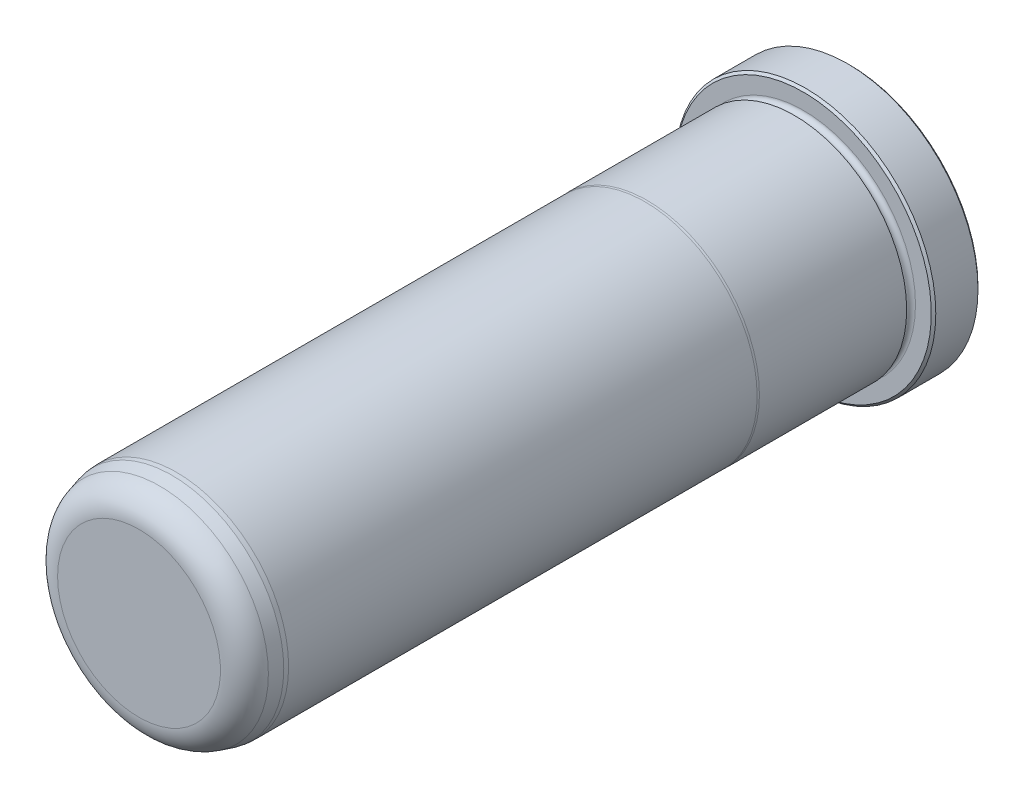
ISO-10303-21;
HEADER;
FILE_DESCRIPTION(('STEP AP214'),'2;1');
FILE_NAME('part.step','',(''),(''),'','','');
FILE_SCHEMA(('AUTOMOTIVE_DESIGN { 1 0 10303 214 1 1 1 1 }'));
ENDSEC;
DATA;
#1=APPLICATION_CONTEXT('core data for automotive mechanical design processes');
#2=APPLICATION_PROTOCOL_DEFINITION('international standard','automotive_design',2000,#1);
#3=PRODUCT_CONTEXT('',#1,'mechanical');
#4=PRODUCT('Part','Part','',(#3));
#5=PRODUCT_RELATED_PRODUCT_CATEGORY('part','',(#4));
#6=PRODUCT_DEFINITION_FORMATION('','',#4);
#7=PRODUCT_DEFINITION_CONTEXT('part definition',#1,'design');
#8=PRODUCT_DEFINITION('design','',#6,#7);
#9=PRODUCT_DEFINITION_SHAPE('','',#8);
#10=(LENGTH_UNIT() NAMED_UNIT(*) SI_UNIT(.MILLI.,.METRE.));
#11=(NAMED_UNIT(*) PLANE_ANGLE_UNIT() SI_UNIT($,.RADIAN.));
#12=(NAMED_UNIT(*) SI_UNIT($,.STERADIAN.) SOLID_ANGLE_UNIT());
#13=UNCERTAINTY_MEASURE_WITH_UNIT(LENGTH_MEASURE(1.E-05),#10,'distance_accuracy_value','');
#14=(GEOMETRIC_REPRESENTATION_CONTEXT(3) GLOBAL_UNCERTAINTY_ASSIGNED_CONTEXT((#13)) GLOBAL_UNIT_ASSIGNED_CONTEXT((#10,
#11,#12)) REPRESENTATION_CONTEXT('',''));
#15=CARTESIAN_POINT('',(0.,0.,0.));
#16=DIRECTION('',(0.,0.,1.));
#17=DIRECTION('',(1.,0.,0.));
#18=AXIS2_PLACEMENT_3D('',#15,#16,#17);
#19=CARTESIAN_POINT('',(0.,0.,0.));
#20=DIRECTION('',(0.,0.,1.));
#21=DIRECTION('',(1.,0.,0.));
#22=AXIS2_PLACEMENT_3D('',#19,#20,#21);
#23=PLANE('',#22);
#24=CARTESIAN_POINT('',(0.,0.,0.));
#25=DIRECTION('',(0.,0.,1.));
#26=DIRECTION('',(1.,0.,0.));
#27=AXIS2_PLACEMENT_3D('',#24,#25,#26);
#28=CIRCLE('',#27,21.717);
#29=CARTESIAN_POINT('',(21.717,0.,0.));
#30=VERTEX_POINT('',#29);
#31=EDGE_CURVE('E37',#30,#30,#28,.F.);
#32=ORIENTED_EDGE('',*,*,#31,.T.);
#33=EDGE_LOOP('',(#32));
#34=FACE_BOUND('',#33,.T.);
#35=ADVANCED_FACE('F30',(#34),#23,.F.);
#36=CARTESIAN_POINT('',(0.,0.,0.));
#37=DIRECTION('',(0.,0.,1.));
#38=DIRECTION('',(1.,0.,0.));
#39=AXIS2_PLACEMENT_3D('',#36,#37,#38);
#40=CYLINDRICAL_SURFACE('',#39,22.098);
#41=CARTESIAN_POINT('',(0.,0.,0.38100000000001));
#42=DIRECTION('',(0.,0.,1.));
#43=DIRECTION('',(1.,0.,0.));
#44=AXIS2_PLACEMENT_3D('',#41,#42,#43);
#45=CIRCLE('',#44,22.098);
#46=CARTESIAN_POINT('',(22.098,0.,0.38100000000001));
#47=VERTEX_POINT('',#46);
#48=EDGE_CURVE('E41',#47,#47,#45,.T.);
#49=ORIENTED_EDGE('',*,*,#48,.T.);
#50=EDGE_LOOP('',(#49));
#51=FACE_BOUND('',#50,.T.);
#52=CARTESIAN_POINT('',(0.,0.,7.5438));
#53=DIRECTION('',(0.,0.,-1.));
#54=DIRECTION('',(-1.,0.,0.));
#55=AXIS2_PLACEMENT_3D('',#52,#53,#54);
#56=CIRCLE('',#55,22.098);
#57=CARTESIAN_POINT('',(-22.098,0.,7.5438));
#58=VERTEX_POINT('',#57);
#59=EDGE_CURVE('E45',#58,#58,#56,.T.);
#60=ORIENTED_EDGE('',*,*,#59,.T.);
#61=EDGE_LOOP('',(#60));
#62=FACE_BOUND('',#61,.T.);
#63=ADVANCED_FACE('F118',(#51,#62),#40,.T.);
#64=CARTESIAN_POINT('',(0.,22.098,7.9248));
#65=DIRECTION('',(0.,0.,-1.));
#66=DIRECTION('',(-1.,0.,0.));
#67=AXIS2_PLACEMENT_3D('',#64,#65,#66);
#68=PLANE('',#67);
#69=CARTESIAN_POINT('',(0.,0.,7.9248));
#70=DIRECTION('',(0.,0.,-1.));
#71=DIRECTION('',(-1.,0.,0.));
#72=AXIS2_PLACEMENT_3D('',#69,#70,#71);
#73=CIRCLE('',#72,21.717);
#74=CARTESIAN_POINT('',(-21.717,0.,7.9248));
#75=VERTEX_POINT('',#74);
#76=EDGE_CURVE('E10',#75,#75,#73,.F.);
#77=ORIENTED_EDGE('',*,*,#76,.T.);
#78=EDGE_LOOP('',(#77));
#79=FACE_BOUND('',#78,.T.);
#80=CARTESIAN_POINT('',(0.,0.,7.9248));
#81=DIRECTION('',(0.,0.,1.));
#82=DIRECTION('',(1.,0.,0.));
#83=AXIS2_PLACEMENT_3D('',#80,#81,#82);
#84=CIRCLE('',#83,19.0373);
#85=CARTESIAN_POINT('',(19.0373,0.,7.9248));
#86=VERTEX_POINT('',#85);
#87=EDGE_CURVE('E56',#86,#86,#84,.T.);
#88=ORIENTED_EDGE('',*,*,#87,.F.);
#89=EDGE_LOOP('',(#88));
#90=FACE_BOUND('',#89,.T.);
#91=ADVANCED_FACE('F113',(#79,#90),#68,.F.);
#92=CARTESIAN_POINT('',(0.,0.,8.6868));
#93=DIRECTION('',(0.,0.,1.));
#94=DIRECTION('',(1.,0.,0.));
#95=AXIS2_PLACEMENT_3D('',#92,#93,#94);
#96=TOROIDAL_SURFACE('',#95,19.0373,0.762);
#97=CARTESIAN_POINT('',(0.,0.,9.4488));
#98=DIRECTION('',(0.,0.,1.));
#99=DIRECTION('',(1.,0.,0.));
#100=AXIS2_PLACEMENT_3D('',#97,#98,#99);
#101=CIRCLE('',#100,19.0373);
#102=CARTESIAN_POINT('',(19.0373,0.,9.4488));
#103=VERTEX_POINT('',#102);
#104=EDGE_CURVE('E59',#103,#103,#101,.T.);
#105=ORIENTED_EDGE('',*,*,#104,.F.);
#106=EDGE_LOOP('',(#105));
#107=FACE_BOUND('',#106,.T.);
#108=ORIENTED_EDGE('',*,*,#87,.T.);
#109=EDGE_LOOP('',(#108));
#110=FACE_BOUND('',#109,.T.);
#111=ADVANCED_FACE('F107',(#107,#110),#96,.F.);
#112=CARTESIAN_POINT('',(0.,19.0373,9.4488));
#113=DIRECTION('',(0.,0.,1.));
#114=DIRECTION('',(1.,0.,0.));
#115=AXIS2_PLACEMENT_3D('',#112,#113,#114);
#116=PLANE('',#115);
#117=CARTESIAN_POINT('',(0.,0.,9.4488));
#118=DIRECTION('',(0.,0.,1.));
#119=DIRECTION('',(1.,0.,0.));
#120=AXIS2_PLACEMENT_3D('',#117,#118,#119);
#121=CIRCLE('',#120,19.0627);
#122=CARTESIAN_POINT('',(19.0627,0.,9.4488));
#123=VERTEX_POINT('',#122);
#124=EDGE_CURVE('E62',#123,#123,#121,.T.);
#125=ORIENTED_EDGE('',*,*,#124,.F.);
#126=EDGE_LOOP('',(#125));
#127=FACE_BOUND('',#126,.T.);
#128=ORIENTED_EDGE('',*,*,#104,.T.);
#129=EDGE_LOOP('',(#128));
#130=FACE_BOUND('',#129,.T.);
#131=ADVANCED_FACE('F101',(#127,#130),#116,.F.);
#132=CARTESIAN_POINT('',(0.,0.,0.));
#133=DIRECTION('',(0.,0.,1.));
#134=DIRECTION('',(1.,0.,0.));
#135=AXIS2_PLACEMENT_3D('',#132,#133,#134);
#136=CYLINDRICAL_SURFACE('',#135,19.0627);
#137=CARTESIAN_POINT('',(0.,0.,34.4347630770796));
#138=DIRECTION('',(0.,0.,1.));
#139=DIRECTION('',(1.,0.,0.));
#140=AXIS2_PLACEMENT_3D('',#137,#138,#139);
#141=CIRCLE('',#140,19.0627);
#142=CARTESIAN_POINT('',(19.0627,0.,34.4347630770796));
#143=VERTEX_POINT('',#142);
#144=EDGE_CURVE('E65',#143,#143,#141,.T.);
#145=ORIENTED_EDGE('',*,*,#144,.F.);
#146=EDGE_LOOP('',(#145));
#147=FACE_BOUND('',#146,.T.);
#148=ORIENTED_EDGE('',*,*,#124,.T.);
#149=EDGE_LOOP('',(#148));
#150=FACE_BOUND('',#149,.T.);
#151=ADVANCED_FACE('F95',(#147,#150),#136,.T.);
#152=CARTESIAN_POINT('',(0.,0.,34.4347630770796));
#153=DIRECTION('',(0.,0.,-1.));
#154=DIRECTION('',(-1.,0.,0.));
#155=AXIS2_PLACEMENT_3D('',#152,#153,#154);
#156=CONICAL_SURFACE('',#155,19.0627,0.0698131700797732);
#157=CARTESIAN_POINT('',(0.,0.,34.798));
#158=DIRECTION('',(0.,0.,1.));
#159=DIRECTION('',(1.,0.,0.));
#160=AXIS2_PLACEMENT_3D('',#157,#158,#159);
#161=CIRCLE('',#160,19.0373);
#162=CARTESIAN_POINT('',(19.0373,0.,34.798));
#163=VERTEX_POINT('',#162);
#164=EDGE_CURVE('E68',#163,#163,#161,.T.);
#165=ORIENTED_EDGE('',*,*,#164,.F.);
#166=EDGE_LOOP('',(#165));
#167=FACE_BOUND('',#166,.T.);
#168=ORIENTED_EDGE('',*,*,#144,.T.);
#169=EDGE_LOOP('',(#168));
#170=FACE_BOUND('',#169,.T.);
#171=ADVANCED_FACE('F89',(#167,#170),#156,.T.);
#172=CARTESIAN_POINT('',(0.,0.,0.));
#173=DIRECTION('',(0.,0.,1.));
#174=DIRECTION('',(1.,0.,0.));
#175=AXIS2_PLACEMENT_3D('',#172,#173,#174);
#176=CYLINDRICAL_SURFACE('',#175,19.0373);
#177=CARTESIAN_POINT('',(0.,0.,114.3));
#178=DIRECTION('',(0.,0.,1.));
#179=DIRECTION('',(1.,0.,0.));
#180=AXIS2_PLACEMENT_3D('',#177,#178,#179);
#181=CIRCLE('',#180,19.0373);
#182=CARTESIAN_POINT('',(19.0373,0.,114.3));
#183=VERTEX_POINT('',#182);
#184=EDGE_CURVE('E71',#183,#183,#181,.T.);
#185=ORIENTED_EDGE('',*,*,#184,.F.);
#186=EDGE_LOOP('',(#185));
#187=FACE_BOUND('',#186,.T.);
#188=ORIENTED_EDGE('',*,*,#164,.T.);
#189=EDGE_LOOP('',(#188));
#190=FACE_BOUND('',#189,.T.);
#191=ADVANCED_FACE('F83',(#187,#190),#176,.T.);
#192=CARTESIAN_POINT('',(0.,0.,114.3));
#193=DIRECTION('',(0.,0.,-1.));
#194=DIRECTION('',(-1.,0.,0.));
#195=AXIS2_PLACEMENT_3D('',#192,#193,#194);
#196=CONICAL_SURFACE('',#195,19.0373,0.0872664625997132);
#197=CARTESIAN_POINT('',(0.,0.,115.062));
#198=DIRECTION('',(0.,0.,1.));
#199=DIRECTION('',(1.,0.,0.));
#200=AXIS2_PLACEMENT_3D('',#197,#198,#199);
#201=CIRCLE('',#200,18.9706336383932);
#202=CARTESIAN_POINT('',(18.9706336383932,0.,115.062));
#203=VERTEX_POINT('',#202);
#204=EDGE_CURVE('E74',#203,#203,#201,.T.);
#205=ORIENTED_EDGE('',*,*,#204,.F.);
#206=EDGE_LOOP('',(#205));
#207=FACE_BOUND('',#206,.T.);
#208=ORIENTED_EDGE('',*,*,#184,.T.);
#209=EDGE_LOOP('',(#208));
#210=FACE_BOUND('',#209,.T.);
#211=ADVANCED_FACE('F80',(#207,#210),#196,.T.);
#212=CARTESIAN_POINT('',(0.,0.,115.062));
#213=DIRECTION('',(0.,0.,-1.));
#214=DIRECTION('',(-1.,0.,0.));
#215=AXIS2_PLACEMENT_3D('',#212,#213,#214);
#216=CONICAL_SURFACE('',#215,18.9706336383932,0.26179938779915);
#217=CARTESIAN_POINT('',(0.,0.,117.120125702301));
#218=DIRECTION('',(0.,0.,1.));
#219=DIRECTION('',(1.,0.,0.));
#220=AXIS2_PLACEMENT_3D('',#217,#218,#219);
#221=CIRCLE('',#220,18.41916051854);
#222=CARTESIAN_POINT('',(18.41916051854,0.,117.120125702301));
#223=VERTEX_POINT('',#222);
#224=EDGE_CURVE('E50',#223,#223,#221,.F.);
#225=ORIENTED_EDGE('',*,*,#224,.T.);
#226=EDGE_LOOP('',(#225));
#227=FACE_BOUND('',#226,.T.);
#228=ORIENTED_EDGE('',*,*,#204,.T.);
#229=EDGE_LOOP('',(#228));
#230=FACE_BOUND('',#229,.T.);
#231=ADVANCED_FACE('F78',(#227,#230),#216,.T.);
#232=CARTESIAN_POINT('',(0.,17.4733335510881,120.65));
#233=DIRECTION('',(0.,0.,-1.));
#234=DIRECTION('',(-1.,0.,0.));
#235=AXIS2_PLACEMENT_3D('',#232,#233,#234);
#236=PLANE('',#235);
#237=CARTESIAN_POINT('',(0.,0.,120.65));
#238=DIRECTION('',(0.,0.,-1.));
#239=DIRECTION('',(-1.,0.,0.));
#240=AXIS2_PLACEMENT_3D('',#237,#238,#239);
#241=CIRCLE('',#240,13.8189387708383);
#242=CARTESIAN_POINT('',(-13.8189387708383,0.,120.65));
#243=VERTEX_POINT('',#242);
#244=EDGE_CURVE('E53',#243,#243,#241,.F.);
#245=ORIENTED_EDGE('',*,*,#244,.T.);
#246=EDGE_LOOP('',(#245));
#247=FACE_BOUND('',#246,.T.);
#248=ADVANCED_FACE('F133',(#247),#236,.F.);
#249=CARTESIAN_POINT('',(0.,0.,115.8875));
#250=DIRECTION('',(0.,0.,-1.));
#251=DIRECTION('',(-1.,0.,0.));
#252=AXIS2_PLACEMENT_3D('',#249,#250,#251);
#253=TOROIDAL_SURFACE('',#252,13.8189387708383,4.7625);
#254=ORIENTED_EDGE('',*,*,#224,.F.);
#255=EDGE_LOOP('',(#254));
#256=FACE_BOUND('',#255,.T.);
#257=ORIENTED_EDGE('',*,*,#244,.F.);
#258=EDGE_LOOP('',(#257));
#259=FACE_BOUND('',#258,.T.);
#260=ADVANCED_FACE('F130',(#256,#259),#253,.T.);
#261=CARTESIAN_POINT('',(0.,0.,0.38100000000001));
#262=DIRECTION('',(0.,0.,1.));
#263=DIRECTION('',(1.,0.,0.));
#264=AXIS2_PLACEMENT_3D('',#261,#262,#263);
#265=CONICAL_SURFACE('',#264,22.098,0.785398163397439);
#266=ORIENTED_EDGE('',*,*,#31,.F.);
#267=EDGE_LOOP('',(#266));
#268=FACE_BOUND('',#267,.T.);
#269=ORIENTED_EDGE('',*,*,#48,.F.);
#270=EDGE_LOOP('',(#269));
#271=FACE_BOUND('',#270,.T.);
#272=ADVANCED_FACE('F132',(#268,#271),#265,.T.);
#273=CARTESIAN_POINT('',(0.,0.,7.9248));
#274=DIRECTION('',(0.,0.,-1.));
#275=DIRECTION('',(-1.,0.,0.));
#276=AXIS2_PLACEMENT_3D('',#273,#274,#275);
#277=CONICAL_SURFACE('',#276,21.717,0.785398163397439);
#278=ORIENTED_EDGE('',*,*,#59,.F.);
#279=EDGE_LOOP('',(#278));
#280=FACE_BOUND('',#279,.T.);
#281=ORIENTED_EDGE('',*,*,#76,.F.);
#282=EDGE_LOOP('',(#281));
#283=FACE_BOUND('',#282,.T.);
#284=ADVANCED_FACE('F32',(#280,#283),#277,.T.);
#285=CLOSED_SHELL('',(#35,#63,#91,#111,#131,#151,#171,#191,#211,#231,#248,#260,#272,#284));
#286=MANIFOLD_SOLID_BREP('B2',#285);
#287=ADVANCED_BREP_SHAPE_REPRESENTATION('',(#18,#286),#14);
#288=SHAPE_DEFINITION_REPRESENTATION(#9,#287);
ENDSEC;
END-ISO-10303-21;
